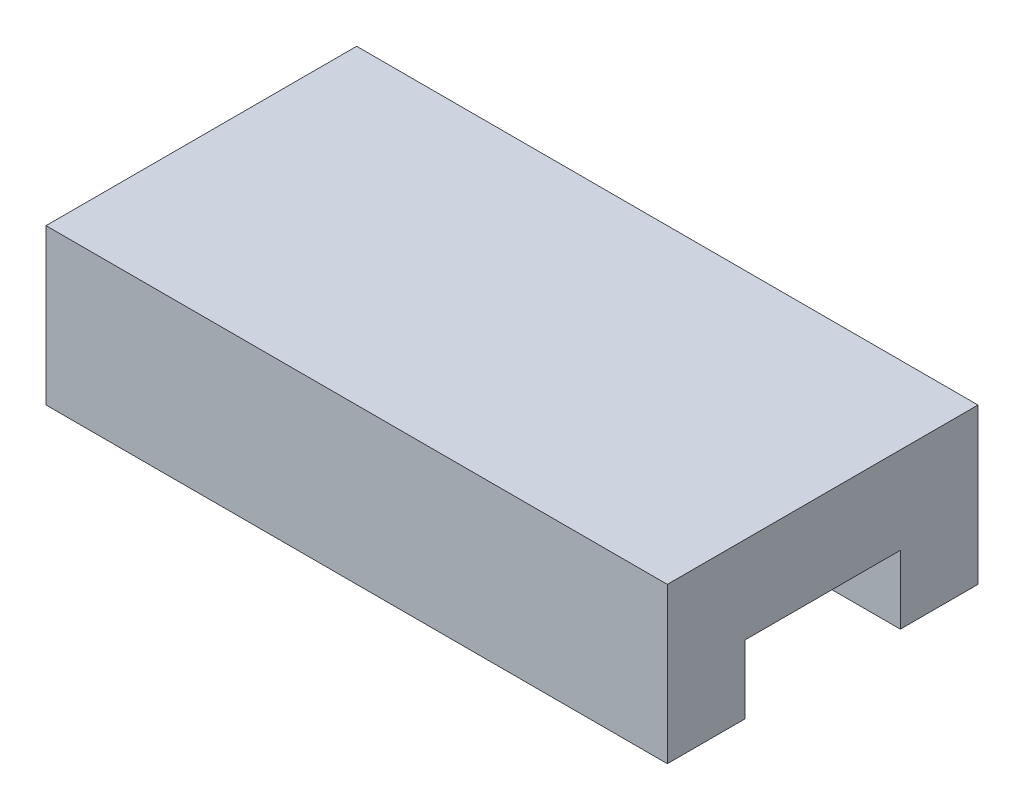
ISO-10303-21;
HEADER;
FILE_DESCRIPTION(('STEP AP214'),'2;1');
FILE_NAME('part.step','',(''),(''),'','','');
FILE_SCHEMA(('AUTOMOTIVE_DESIGN { 1 0 10303 214 1 1 1 1 }'));
ENDSEC;
DATA;
#1=APPLICATION_CONTEXT('core data for automotive mechanical design processes');
#2=APPLICATION_PROTOCOL_DEFINITION('international standard','automotive_design',2000,#1);
#3=PRODUCT_CONTEXT('',#1,'mechanical');
#4=PRODUCT('Part','Part','',(#3));
#5=PRODUCT_RELATED_PRODUCT_CATEGORY('part','',(#4));
#6=PRODUCT_DEFINITION_FORMATION('','',#4);
#7=PRODUCT_DEFINITION_CONTEXT('part definition',#1,'design');
#8=PRODUCT_DEFINITION('design','',#6,#7);
#9=PRODUCT_DEFINITION_SHAPE('','',#8);
#10=(LENGTH_UNIT() NAMED_UNIT(*) SI_UNIT(.MILLI.,.METRE.));
#11=(NAMED_UNIT(*) PLANE_ANGLE_UNIT() SI_UNIT($,.RADIAN.));
#12=(NAMED_UNIT(*) SI_UNIT($,.STERADIAN.) SOLID_ANGLE_UNIT());
#13=UNCERTAINTY_MEASURE_WITH_UNIT(LENGTH_MEASURE(1.E-05),#10,'distance_accuracy_value','');
#14=(GEOMETRIC_REPRESENTATION_CONTEXT(3) GLOBAL_UNCERTAINTY_ASSIGNED_CONTEXT((#13)) GLOBAL_UNIT_ASSIGNED_CONTEXT((#10,
#11,#12)) REPRESENTATION_CONTEXT('',''));
#15=CARTESIAN_POINT('',(0.,0.,0.));
#16=DIRECTION('',(0.,0.,1.));
#17=DIRECTION('',(1.,0.,0.));
#18=AXIS2_PLACEMENT_3D('',#15,#16,#17);
#19=CARTESIAN_POINT('',(-100.,0.,-100.));
#20=DIRECTION('',(0.,-1.,0.));
#21=DIRECTION('',(0.,0.,-1.));
#22=AXIS2_PLACEMENT_3D('',#19,#20,#21);
#23=PLANE('',#22);
#24=DIRECTION('',(-1.,0.,0.));
#25=VECTOR('',#24,1.);
#26=CARTESIAN_POINT('',(100.,0.,-75.));
#27=LINE('',#26,#25);
#28=CARTESIAN_POINT('',(100.,0.,-75.));
#29=VERTEX_POINT('',#28);
#30=CARTESIAN_POINT('',(-100.,0.,-75.));
#31=VERTEX_POINT('',#30);
#32=EDGE_CURVE('E134',#29,#31,#27,.T.);
#33=ORIENTED_EDGE('',*,*,#32,.T.);
#34=DIRECTION('',(0.,0.,1.));
#35=VECTOR('',#34,1.);
#36=CARTESIAN_POINT('',(-100.,0.,-100.));
#37=LINE('',#36,#35);
#38=CARTESIAN_POINT('',(-100.,0.,-100.));
#39=VERTEX_POINT('',#38);
#40=EDGE_CURVE('E35',#39,#31,#37,.T.);
#41=ORIENTED_EDGE('',*,*,#40,.F.);
#42=DIRECTION('',(1.,0.,0.));
#43=VECTOR('',#42,1.);
#44=CARTESIAN_POINT('',(-100.,0.,-100.));
#45=LINE('',#44,#43);
#46=CARTESIAN_POINT('',(100.,0.,-100.));
#47=VERTEX_POINT('',#46);
#48=EDGE_CURVE('E141',#39,#47,#45,.T.);
#49=ORIENTED_EDGE('',*,*,#48,.T.);
#50=DIRECTION('',(0.,0.,1.));
#51=VECTOR('',#50,1.);
#52=CARTESIAN_POINT('',(100.,0.,-100.));
#53=LINE('',#52,#51);
#54=EDGE_CURVE('E160',#47,#29,#53,.T.);
#55=ORIENTED_EDGE('',*,*,#54,.T.);
#56=EDGE_LOOP('',(#33,#41,#49,#55));
#57=FACE_BOUND('',#56,.T.);
#58=ADVANCED_FACE('F31',(#57),#23,.T.);
#59=CARTESIAN_POINT('',(-100.,50.,-100.));
#60=DIRECTION('',(-1.,0.,0.));
#61=DIRECTION('',(0.,-1.,0.));
#62=AXIS2_PLACEMENT_3D('',#59,#60,#61);
#63=PLANE('',#62);
#64=DIRECTION('',(0.,-1.,0.));
#65=VECTOR('',#64,1.);
#66=CARTESIAN_POINT('',(-100.,22.,-75.));
#67=LINE('',#66,#65);
#68=CARTESIAN_POINT('',(-100.,22.,-75.));
#69=VERTEX_POINT('',#68);
#70=EDGE_CURVE('E126',#69,#31,#67,.T.);
#71=ORIENTED_EDGE('',*,*,#70,.F.);
#72=DIRECTION('',(0.,0.,-1.));
#73=VECTOR('',#72,1.);
#74=CARTESIAN_POINT('',(-100.,22.,-25.));
#75=LINE('',#74,#73);
#76=CARTESIAN_POINT('',(-100.,22.,-25.));
#77=VERTEX_POINT('',#76);
#78=EDGE_CURVE('E128',#77,#69,#75,.T.);
#79=ORIENTED_EDGE('',*,*,#78,.F.);
#80=DIRECTION('',(0.,1.,0.));
#81=VECTOR('',#80,1.);
#82=CARTESIAN_POINT('',(-100.,0.,-25.));
#83=LINE('',#82,#81);
#84=CARTESIAN_POINT('',(-100.,0.,-25.));
#85=VERTEX_POINT('',#84);
#86=EDGE_CURVE('E107',#85,#77,#83,.T.);
#87=ORIENTED_EDGE('',*,*,#86,.F.);
#88=CARTESIAN_POINT('',(-100.,0.,0.));
#89=VERTEX_POINT('',#88);
#90=EDGE_CURVE('E149',#85,#89,#37,.T.);
#91=ORIENTED_EDGE('',*,*,#90,.T.);
#92=DIRECTION('',(0.,-1.,0.));
#93=VECTOR('',#92,1.);
#94=CARTESIAN_POINT('',(-100.,50.,0.));
#95=LINE('',#94,#93);
#96=CARTESIAN_POINT('',(-100.,50.,0.));
#97=VERTEX_POINT('',#96);
#98=EDGE_CURVE('E136',#97,#89,#95,.T.);
#99=ORIENTED_EDGE('',*,*,#98,.F.);
#100=DIRECTION('',(0.,0.,1.));
#101=VECTOR('',#100,1.);
#102=CARTESIAN_POINT('',(-100.,50.,-100.));
#103=LINE('',#102,#101);
#104=CARTESIAN_POINT('',(-100.,50.,-100.));
#105=VERTEX_POINT('',#104);
#106=EDGE_CURVE('E11',#105,#97,#103,.T.);
#107=ORIENTED_EDGE('',*,*,#106,.F.);
#108=DIRECTION('',(0.,-1.,0.));
#109=VECTOR('',#108,1.);
#110=CARTESIAN_POINT('',(-100.,50.,-100.));
#111=LINE('',#110,#109);
#112=EDGE_CURVE('E139',#105,#39,#111,.T.);
#113=ORIENTED_EDGE('',*,*,#112,.T.);
#114=ORIENTED_EDGE('',*,*,#40,.T.);
#115=EDGE_LOOP('',(#71,#79,#87,#91,#99,#107,#113,#114));
#116=FACE_BOUND('',#115,.T.);
#117=ADVANCED_FACE('F33',(#116),#63,.T.);
#118=CARTESIAN_POINT('',(-100.,50.,-100.));
#119=DIRECTION('',(0.,1.,0.));
#120=DIRECTION('',(-1.,0.,0.));
#121=AXIS2_PLACEMENT_3D('',#118,#119,#120);
#122=PLANE('',#121);
#123=DIRECTION('',(-1.,0.,0.));
#124=VECTOR('',#123,1.);
#125=CARTESIAN_POINT('',(-100.,50.,0.));
#126=LINE('',#125,#124);
#127=CARTESIAN_POINT('',(100.,50.,0.));
#128=VERTEX_POINT('',#127);
#129=EDGE_CURVE('E142',#128,#97,#126,.T.);
#130=ORIENTED_EDGE('',*,*,#129,.F.);
#131=DIRECTION('',(0.,0.,1.));
#132=VECTOR('',#131,1.);
#133=CARTESIAN_POINT('',(100.,50.,-100.));
#134=LINE('',#133,#132);
#135=CARTESIAN_POINT('',(100.,50.,-100.));
#136=VERTEX_POINT('',#135);
#137=EDGE_CURVE('E40',#136,#128,#134,.T.);
#138=ORIENTED_EDGE('',*,*,#137,.F.);
#139=DIRECTION('',(-1.,0.,0.));
#140=VECTOR('',#139,1.);
#141=CARTESIAN_POINT('',(-100.,50.,-100.));
#142=LINE('',#141,#140);
#143=EDGE_CURVE('E147',#136,#105,#142,.T.);
#144=ORIENTED_EDGE('',*,*,#143,.T.);
#145=ORIENTED_EDGE('',*,*,#106,.T.);
#146=EDGE_LOOP('',(#130,#138,#144,#145));
#147=FACE_BOUND('',#146,.T.);
#148=ADVANCED_FACE('F169',(#147),#122,.T.);
#149=CARTESIAN_POINT('',(100.,50.,-100.));
#150=DIRECTION('',(1.,0.,0.));
#151=DIRECTION('',(0.,1.,0.));
#152=AXIS2_PLACEMENT_3D('',#149,#150,#151);
#153=PLANE('',#152);
#154=DIRECTION('',(0.,-1.,0.));
#155=VECTOR('',#154,1.);
#156=CARTESIAN_POINT('',(100.,21.9999999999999,-75.));
#157=LINE('',#156,#155);
#158=CARTESIAN_POINT('',(100.,21.9999999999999,-75.));
#159=VERTEX_POINT('',#158);
#160=EDGE_CURVE('E120',#159,#29,#157,.T.);
#161=ORIENTED_EDGE('',*,*,#160,.T.);
#162=ORIENTED_EDGE('',*,*,#54,.F.);
#163=DIRECTION('',(0.,1.,0.));
#164=VECTOR('',#163,1.);
#165=CARTESIAN_POINT('',(100.,50.,-100.));
#166=LINE('',#165,#164);
#167=EDGE_CURVE('E144',#47,#136,#166,.T.);
#168=ORIENTED_EDGE('',*,*,#167,.T.);
#169=ORIENTED_EDGE('',*,*,#137,.T.);
#170=DIRECTION('',(0.,1.,0.));
#171=VECTOR('',#170,1.);
#172=CARTESIAN_POINT('',(100.,50.,0.));
#173=LINE('',#172,#171);
#174=CARTESIAN_POINT('',(100.,0.,0.));
#175=VERTEX_POINT('',#174);
#176=EDGE_CURVE('E155',#175,#128,#173,.T.);
#177=ORIENTED_EDGE('',*,*,#176,.F.);
#178=CARTESIAN_POINT('',(100.,0.,-25.));
#179=VERTEX_POINT('',#178);
#180=EDGE_CURVE('E125',#179,#175,#53,.T.);
#181=ORIENTED_EDGE('',*,*,#180,.F.);
#182=DIRECTION('',(0.,1.,0.));
#183=VECTOR('',#182,1.);
#184=CARTESIAN_POINT('',(100.,0.,-25.));
#185=LINE('',#184,#183);
#186=CARTESIAN_POINT('',(100.,21.9999999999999,-25.));
#187=VERTEX_POINT('',#186);
#188=EDGE_CURVE('E48',#179,#187,#185,.T.);
#189=ORIENTED_EDGE('',*,*,#188,.T.);
#190=DIRECTION('',(0.,0.,-1.));
#191=VECTOR('',#190,1.);
#192=CARTESIAN_POINT('',(100.,21.9999999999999,-25.));
#193=LINE('',#192,#191);
#194=EDGE_CURVE('E115',#187,#159,#193,.T.);
#195=ORIENTED_EDGE('',*,*,#194,.T.);
#196=EDGE_LOOP('',(#161,#162,#168,#169,#177,#181,#189,#195));
#197=FACE_BOUND('',#196,.T.);
#198=ADVANCED_FACE('F123',(#197),#153,.T.);
#199=DIRECTION('',(-1.,0.,0.));
#200=VECTOR('',#199,1.);
#201=CARTESIAN_POINT('',(100.,0.,-25.));
#202=LINE('',#201,#200);
#203=EDGE_CURVE('E112',#179,#85,#202,.T.);
#204=ORIENTED_EDGE('',*,*,#203,.F.);
#205=ORIENTED_EDGE('',*,*,#180,.T.);
#206=DIRECTION('',(1.,0.,0.));
#207=VECTOR('',#206,1.);
#208=CARTESIAN_POINT('',(-100.,0.,0.));
#209=LINE('',#208,#207);
#210=EDGE_CURVE('E152',#89,#175,#209,.T.);
#211=ORIENTED_EDGE('',*,*,#210,.F.);
#212=ORIENTED_EDGE('',*,*,#90,.F.);
#213=EDGE_LOOP('',(#204,#205,#211,#212));
#214=FACE_BOUND('',#213,.T.);
#215=ADVANCED_FACE('F166',(#214),#23,.T.);
#216=CARTESIAN_POINT('',(-100.,50.,-100.));
#217=DIRECTION('',(0.,0.,1.));
#218=DIRECTION('',(1.,0.,0.));
#219=AXIS2_PLACEMENT_3D('',#216,#217,#218);
#220=PLANE('',#219);
#221=ORIENTED_EDGE('',*,*,#112,.F.);
#222=ORIENTED_EDGE('',*,*,#143,.F.);
#223=ORIENTED_EDGE('',*,*,#167,.F.);
#224=ORIENTED_EDGE('',*,*,#48,.F.);
#225=EDGE_LOOP('',(#221,#222,#223,#224));
#226=FACE_BOUND('',#225,.T.);
#227=ADVANCED_FACE('F173',(#226),#220,.F.);
#228=CARTESIAN_POINT('',(-100.,50.,0.));
#229=DIRECTION('',(0.,0.,1.));
#230=DIRECTION('',(1.,0.,0.));
#231=AXIS2_PLACEMENT_3D('',#228,#229,#230);
#232=PLANE('',#231);
#233=ORIENTED_EDGE('',*,*,#98,.T.);
#234=ORIENTED_EDGE('',*,*,#210,.T.);
#235=ORIENTED_EDGE('',*,*,#176,.T.);
#236=ORIENTED_EDGE('',*,*,#129,.T.);
#237=EDGE_LOOP('',(#233,#234,#235,#236));
#238=FACE_BOUND('',#237,.T.);
#239=ADVANCED_FACE('F168',(#238),#232,.T.);
#240=CARTESIAN_POINT('',(100.,21.9999999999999,-75.));
#241=DIRECTION('',(0.,0.,-1.));
#242=DIRECTION('',(-1.,0.,0.));
#243=AXIS2_PLACEMENT_3D('',#240,#241,#242);
#244=PLANE('',#243);
#245=ORIENTED_EDGE('',*,*,#70,.T.);
#246=ORIENTED_EDGE('',*,*,#32,.F.);
#247=ORIENTED_EDGE('',*,*,#160,.F.);
#248=DIRECTION('',(-1.,0.,0.));
#249=VECTOR('',#248,1.);
#250=CARTESIAN_POINT('',(100.,21.9999999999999,-75.));
#251=LINE('',#250,#249);
#252=EDGE_CURVE('E111',#159,#69,#251,.T.);
#253=ORIENTED_EDGE('',*,*,#252,.T.);
#254=EDGE_LOOP('',(#245,#246,#247,#253));
#255=FACE_BOUND('',#254,.T.);
#256=ADVANCED_FACE('F191',(#255),#244,.F.);
#257=CARTESIAN_POINT('',(100.,21.9999999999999,-25.));
#258=DIRECTION('',(0.,1.,0.));
#259=DIRECTION('',(-1.,0.,0.));
#260=AXIS2_PLACEMENT_3D('',#257,#258,#259);
#261=PLANE('',#260);
#262=ORIENTED_EDGE('',*,*,#78,.T.);
#263=ORIENTED_EDGE('',*,*,#252,.F.);
#264=ORIENTED_EDGE('',*,*,#194,.F.);
#265=DIRECTION('',(-1.,0.,0.));
#266=VECTOR('',#265,1.);
#267=CARTESIAN_POINT('',(100.,21.9999999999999,-25.));
#268=LINE('',#267,#266);
#269=EDGE_CURVE('E103',#187,#77,#268,.T.);
#270=ORIENTED_EDGE('',*,*,#269,.T.);
#271=EDGE_LOOP('',(#262,#263,#264,#270));
#272=FACE_BOUND('',#271,.T.);
#273=ADVANCED_FACE('F116',(#272),#261,.F.);
#274=CARTESIAN_POINT('',(100.,0.,-25.));
#275=DIRECTION('',(0.,0.,1.));
#276=DIRECTION('',(1.,0.,0.));
#277=AXIS2_PLACEMENT_3D('',#274,#275,#276);
#278=PLANE('',#277);
#279=ORIENTED_EDGE('',*,*,#86,.T.);
#280=ORIENTED_EDGE('',*,*,#269,.F.);
#281=ORIENTED_EDGE('',*,*,#188,.F.);
#282=ORIENTED_EDGE('',*,*,#203,.T.);
#283=EDGE_LOOP('',(#279,#280,#281,#282));
#284=FACE_BOUND('',#283,.T.);
#285=ADVANCED_FACE('F105',(#284),#278,.F.);
#286=CLOSED_SHELL('',(#58,#117,#148,#198,#215,#227,#239,#256,#273,#285));
#287=MANIFOLD_SOLID_BREP('B2',#286);
#288=ADVANCED_BREP_SHAPE_REPRESENTATION('',(#18,#287),#14);
#289=SHAPE_DEFINITION_REPRESENTATION(#9,#288);
ENDSEC;
END-ISO-10303-21;
